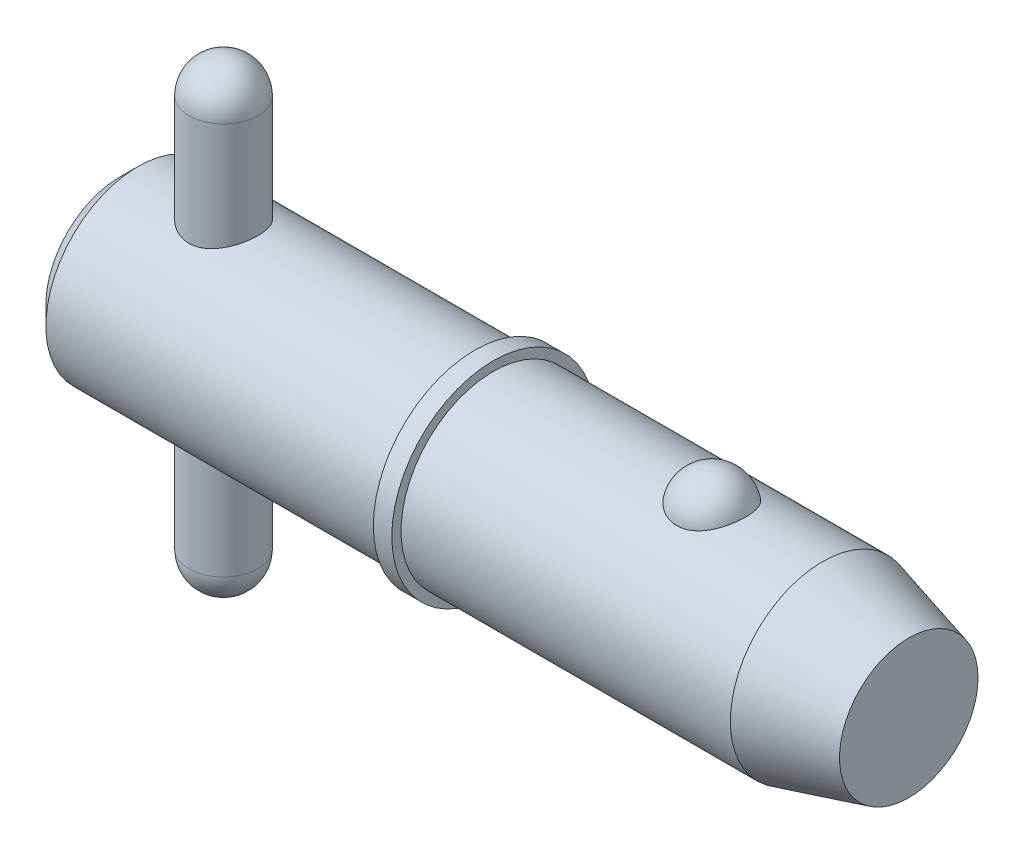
ISO-10303-21;
HEADER;
FILE_DESCRIPTION(('STEP AP214'),'2;1');
FILE_NAME('part.step','',(''),(''),'','','');
FILE_SCHEMA(('AUTOMOTIVE_DESIGN { 1 0 10303 214 1 1 1 1 }'));
ENDSEC;
DATA;
#1=APPLICATION_CONTEXT('core data for automotive mechanical design processes');
#2=APPLICATION_PROTOCOL_DEFINITION('international standard','automotive_design',2000,#1);
#3=PRODUCT_CONTEXT('',#1,'mechanical');
#4=PRODUCT('Part','Part','',(#3));
#5=PRODUCT_RELATED_PRODUCT_CATEGORY('part','',(#4));
#6=PRODUCT_DEFINITION_FORMATION('','',#4);
#7=PRODUCT_DEFINITION_CONTEXT('part definition',#1,'design');
#8=PRODUCT_DEFINITION('design','',#6,#7);
#9=PRODUCT_DEFINITION_SHAPE('','',#8);
#10=(LENGTH_UNIT() NAMED_UNIT(*) SI_UNIT(.MILLI.,.METRE.));
#11=(NAMED_UNIT(*) PLANE_ANGLE_UNIT() SI_UNIT($,.RADIAN.));
#12=(NAMED_UNIT(*) SI_UNIT($,.STERADIAN.) SOLID_ANGLE_UNIT());
#13=UNCERTAINTY_MEASURE_WITH_UNIT(LENGTH_MEASURE(1.E-05),#10,'distance_accuracy_value','');
#14=(GEOMETRIC_REPRESENTATION_CONTEXT(3) GLOBAL_UNCERTAINTY_ASSIGNED_CONTEXT((#13)) GLOBAL_UNIT_ASSIGNED_CONTEXT((#10,
#11,#12)) REPRESENTATION_CONTEXT('',''));
#15=CARTESIAN_POINT('',(0.,0.,0.));
#16=DIRECTION('',(0.,0.,1.));
#17=DIRECTION('',(1.,0.,0.));
#18=AXIS2_PLACEMENT_3D('',#15,#16,#17);
#19=CARTESIAN_POINT('',(7.14,15.875,0.));
#20=DIRECTION('',(0.,-1.,0.));
#21=DIRECTION('',(0.,0.,-1.));
#22=AXIS2_PLACEMENT_3D('',#19,#20,#21);
#23=CYLINDRICAL_SURFACE('',#22,2.38);
#24=CARTESIAN_POINT('',(7.14,-13.495,0.));
#25=DIRECTION('',(0.,-1.,0.));
#26=DIRECTION('',(0.,0.,-1.));
#27=AXIS2_PLACEMENT_3D('',#24,#25,#26);
#28=CIRCLE('',#27,2.38);
#29=CARTESIAN_POINT('',(7.14,-13.495,-2.38));
#30=VERTEX_POINT('',#29);
#31=EDGE_CURVE('P0_E10',#30,#30,#28,.F.);
#32=ORIENTED_EDGE('',*,*,#31,.T.);
#33=EDGE_LOOP('',(#32));
#34=FACE_BOUND('',#33,.T.);
#35=CARTESIAN_POINT('',(7.14,13.495,0.));
#36=DIRECTION('',(0.,-1.,0.));
#37=DIRECTION('',(0.,0.,-1.));
#38=AXIS2_PLACEMENT_3D('',#35,#36,#37);
#39=CIRCLE('',#38,2.38);
#40=CARTESIAN_POINT('',(7.14,13.495,-2.38));
#41=VERTEX_POINT('',#40);
#42=EDGE_CURVE('P0_E21',#41,#41,#39,.T.);
#43=ORIENTED_EDGE('',*,*,#42,.T.);
#44=EDGE_LOOP('',(#43));
#45=FACE_BOUND('',#44,.T.);
#46=ADVANCED_FACE('P0_F14',(#34,#45),#23,.T.);
#47=CARTESIAN_POINT('',(7.14,-13.495,0.));
#48=DIRECTION('',(0.,0.,1.));
#49=DIRECTION('',(1.,0.,0.));
#50=AXIS2_PLACEMENT_3D('',#47,#48,#49);
#51=SPHERICAL_SURFACE('',#50,2.38);
#52=CARTESIAN_POINT('',(7.14,-13.495,0.));
#53=DIRECTION('',(0.,-1.,0.));
#54=DIRECTION('',(0.,0.,-1.));
#55=AXIS2_PLACEMENT_3D('',#52,#53,#54);
#56=SPHERICAL_SURFACE('',#55,2.38);
#57=ORIENTED_EDGE('',*,*,#31,.F.);
#58=EDGE_LOOP('',(#57));
#59=FACE_BOUND('',#58,.T.);
#60=ADVANCED_FACE('P0_F29',(#59),#56,.T.);
#61=CARTESIAN_POINT('',(7.14,13.495,0.));
#62=DIRECTION('',(0.,0.,1.));
#63=DIRECTION('',(1.,0.,0.));
#64=AXIS2_PLACEMENT_3D('',#61,#62,#63);
#65=SPHERICAL_SURFACE('',#64,2.38);
#66=CARTESIAN_POINT('',(7.14,13.495,0.));
#67=DIRECTION('',(0.,-1.,0.));
#68=DIRECTION('',(0.,0.,-1.));
#69=AXIS2_PLACEMENT_3D('',#66,#67,#68);
#70=SPHERICAL_SURFACE('',#69,2.38);
#71=ORIENTED_EDGE('',*,*,#42,.F.);
#72=EDGE_LOOP('',(#71));
#73=FACE_BOUND('',#72,.T.);
#74=ADVANCED_FACE('P0_F16',(#73),#70,.T.);
#75=CLOSED_SHELL('',(#46,#60,#74));
#76=MANIFOLD_SOLID_BREP('P0_B1',#75);
#77=CARTESIAN_POINT('',(0.,0.,0.));
#78=DIRECTION('',(1.,0.,0.));
#79=DIRECTION('',(0.,0.,-1.));
#80=AXIS2_PLACEMENT_3D('',#77,#78,#79);
#81=CYLINDRICAL_SURFACE('',#80,6.35);
#82=CARTESIAN_POINT('',(48.3553693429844,0.,0.));
#83=DIRECTION('',(1.,0.,0.));
#84=DIRECTION('',(0.,0.,-1.));
#85=AXIS2_PLACEMENT_3D('',#82,#83,#84);
#86=CIRCLE('',#85,6.35);
#87=CARTESIAN_POINT('',(48.3553693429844,0.,-6.35));
#88=VERTEX_POINT('',#87);
#89=EDGE_CURVE('P1_E81',#88,#88,#86,.T.);
#90=ORIENTED_EDGE('',*,*,#89,.F.);
#91=EDGE_LOOP('',(#90));
#92=FACE_BOUND('',#91,.T.);
#93=CARTESIAN_POINT('',(25.7,0.,0.));
#94=DIRECTION('',(1.,0.,0.));
#95=DIRECTION('',(0.,0.,-1.));
#96=AXIS2_PLACEMENT_3D('',#93,#94,#95);
#97=CIRCLE('',#96,6.35);
#98=CARTESIAN_POINT('',(25.7,0.,-6.35));
#99=VERTEX_POINT('',#98);
#100=EDGE_CURVE('P1_E85',#99,#99,#97,.T.);
#101=ORIENTED_EDGE('',*,*,#100,.T.);
#102=EDGE_LOOP('',(#101));
#103=FACE_BOUND('',#102,.T.);
#104=CARTESIAN_POINT('',(40.7300214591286,5.87502187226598,2.40969251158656));
#105=CARTESIAN_POINT('',(40.6050305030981,5.87501645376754,2.40969773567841));
#106=CARTESIAN_POINT('',(40.4800806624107,5.87916061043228,2.39967292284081));
#107=CARTESIAN_POINT('',(40.2339091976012,5.89523112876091,2.35991730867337));
#108=CARTESIAN_POINT('',(40.1126863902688,5.90715499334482,2.33019283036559));
#109=CARTESIAN_POINT('',(39.8775170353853,5.9373956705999,2.25201402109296));
#110=CARTESIAN_POINT('',(39.7635602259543,5.95570321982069,2.20358681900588));
#111=CARTESIAN_POINT('',(39.54557352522,5.99672067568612,2.08937987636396));
#112=CARTESIAN_POINT('',(39.4415457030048,6.01943149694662,2.02359652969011));
#113=CARTESIAN_POINT('',(39.2429437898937,6.06760647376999,1.87428969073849));
#114=CARTESIAN_POINT('',(39.1487268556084,6.09313095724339,1.79031110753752));
#115=CARTESIAN_POINT('',(38.9752557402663,6.14375873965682,1.60800178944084));
#116=CARTESIAN_POINT('',(38.8960043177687,6.16886196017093,1.50966841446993));
#117=CARTESIAN_POINT('',(38.7508457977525,6.2172460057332,1.29645884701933));
#118=CARTESIAN_POINT('',(38.6856885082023,6.24039621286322,1.18104158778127));
#119=CARTESIAN_POINT('',(38.5747035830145,6.28117277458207,0.940351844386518));
#120=CARTESIAN_POINT('',(38.5288776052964,6.29879865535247,0.815078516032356));
#121=CARTESIAN_POINT('',(38.4570234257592,6.32692073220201,0.556494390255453));
#122=CARTESIAN_POINT('',(38.431249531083,6.33732517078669,0.423102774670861));
#123=CARTESIAN_POINT('',(38.4009885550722,6.34957673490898,0.153542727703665));
#124=CARTESIAN_POINT('',(38.3965009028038,6.35142408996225,0.0173743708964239));
#125=CARTESIAN_POINT('',(38.4088655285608,6.34638925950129,-0.253036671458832));
#126=CARTESIAN_POINT('',(38.4255949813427,6.33955731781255,-0.387285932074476));
#127=CARTESIAN_POINT('',(38.4798438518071,6.31794129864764,-0.650851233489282));
#128=CARTESIAN_POINT('',(38.5173636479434,6.30315707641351,-0.780167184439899));
#129=CARTESIAN_POINT('',(38.612500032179,6.26711642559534,-1.03041949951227));
#130=CARTESIAN_POINT('',(38.670143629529,6.24585130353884,-1.1513443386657));
#131=CARTESIAN_POINT('',(38.8043522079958,6.19905619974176,-1.38129800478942));
#132=CARTESIAN_POINT('',(38.8809187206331,6.17352587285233,-1.49032586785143));
#133=CARTESIAN_POINT('',(39.051753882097,6.12080227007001,-1.69393164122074));
#134=CARTESIAN_POINT('',(39.1461008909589,6.09360200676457,-1.78844209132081));
#135=CARTESIAN_POINT('',(39.3501196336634,6.0407043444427,-1.95970536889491));
#136=CARTESIAN_POINT('',(39.4597900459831,6.01500681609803,-2.03645972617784));
#137=CARTESIAN_POINT('',(39.6891876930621,5.96867714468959,-2.16845644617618));
#138=CARTESIAN_POINT('',(39.8086522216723,5.94794910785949,-2.22412062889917));
#139=CARTESIAN_POINT('',(40.0562188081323,5.91340580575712,-2.31440992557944));
#140=CARTESIAN_POINT('',(40.1843175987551,5.89958794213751,-2.34904294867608));
#141=CARTESIAN_POINT('',(40.438582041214,5.88111049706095,-2.39491590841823));
#142=CARTESIAN_POINT('',(40.5645207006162,5.876025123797,-2.40724512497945));
#143=CARTESIAN_POINT('',(40.8167867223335,5.87428980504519,-2.41147867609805));
#144=CARTESIAN_POINT('',(40.943114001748,5.87763817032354,-2.40338710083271));
#145=CARTESIAN_POINT('',(41.1884170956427,5.89212921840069,-2.36762715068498));
#146=CARTESIAN_POINT('',(41.3074992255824,5.90302431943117,-2.34058030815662));
#147=CARTESIAN_POINT('',(41.5392447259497,5.93113752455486,-2.26839066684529));
#148=CARTESIAN_POINT('',(41.6519075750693,5.94835614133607,-2.22324640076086));
#149=CARTESIAN_POINT('',(41.8704009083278,5.98773016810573,-2.11493806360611));
#150=CARTESIAN_POINT('',(41.976028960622,6.00998499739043,-2.05140269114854));
#151=CARTESIAN_POINT('',(42.1753006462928,6.0569014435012,-1.90842705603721));
#152=CARTESIAN_POINT('',(42.2689415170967,6.08156361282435,-1.82898313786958));
#153=CARTESIAN_POINT('',(42.4466754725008,6.13211715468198,-1.65182429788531));
#154=CARTESIAN_POINT('',(42.530055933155,6.15800825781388,-1.55339381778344));
#155=CARTESIAN_POINT('',(42.6797900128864,6.20712834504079,-1.34374214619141));
#156=CARTESIAN_POINT('',(42.7461405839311,6.23035685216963,-1.23251867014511));
#157=CARTESIAN_POINT('',(42.8623455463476,6.27251177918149,-0.996447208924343));
#158=CARTESIAN_POINT('',(42.9116072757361,6.29127762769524,-0.871278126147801));
#159=CARTESIAN_POINT('',(42.9896142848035,6.3215862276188,-0.613870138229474));
#160=CARTESIAN_POINT('',(43.0183593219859,6.33312889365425,-0.481631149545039));
#161=CARTESIAN_POINT('',(43.0547705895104,6.34782349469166,-0.213672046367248));
#162=CARTESIAN_POINT('',(43.0624134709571,6.35096613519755,-0.0779482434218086));
#163=CARTESIAN_POINT('',(43.0563951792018,6.34851322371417,0.192943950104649));
#164=CARTESIAN_POINT('',(43.0427343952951,6.3429178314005,0.328112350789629));
#165=CARTESIAN_POINT('',(42.9945036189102,6.32360512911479,0.593406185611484));
#166=CARTESIAN_POINT('',(42.9600313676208,6.30992579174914,0.723552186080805));
#167=CARTESIAN_POINT('',(42.8709539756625,6.27586325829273,0.975834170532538));
#168=CARTESIAN_POINT('',(42.8163476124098,6.25547965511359,1.09796966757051));
#169=CARTESIAN_POINT('',(42.6877587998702,6.20998183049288,1.33148921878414));
#170=CARTESIAN_POINT('',(42.6136742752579,6.18484288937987,1.44281227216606));
#171=CARTESIAN_POINT('',(42.4478204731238,6.13258735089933,1.65087683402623));
#172=CARTESIAN_POINT('',(42.3560515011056,6.10547078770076,1.74761859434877));
#173=CARTESIAN_POINT('',(42.1571839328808,6.05235879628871,1.92350926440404));
#174=CARTESIAN_POINT('',(42.050133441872,6.02636017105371,2.00271146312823));
#175=CARTESIAN_POINT('',(41.8231384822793,5.97843747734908,2.14154159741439));
#176=CARTESIAN_POINT('',(41.703191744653,5.95651412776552,2.2011660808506));
#177=CARTESIAN_POINT('',(41.4445236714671,5.91812106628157,2.30250570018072));
#178=CARTESIAN_POINT('',(41.3050698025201,5.90217533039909,2.34256795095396));
#179=CARTESIAN_POINT('',(41.0203974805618,5.88063128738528,2.39615214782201));
#180=CARTESIAN_POINT('',(40.8751817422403,5.87502816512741,2.40968644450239));
#181=CARTESIAN_POINT('',(40.7300214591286,5.87502187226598,2.40969251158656));
#182=B_SPLINE_CURVE_WITH_KNOTS('',3,(#104,#105,#106,#107,#108,#109,#110,#111,#112,#113,#114,
#115,#116,#117,#118,#119,#120,#121,#122,#123,#124,#125,#126,#127,#128,#129,#130,#131,#132,#133,
#134,#135,#136,#137,#138,#139,#140,#141,#142,#143,#144,#145,#146,#147,#148,#149,#150,#151,#152,
#153,#154,#155,#156,#157,#158,#159,#160,#161,#162,#163,#164,#165,#166,#167,#168,#169,#170,#171,
#172,#173,#174,#175,#176,#177,#178,#179,#180,#181),.UNSPECIFIED.,.T.,.F.,(4,2,2,2,2,2,2,2,2,2,2,
2,2,2,2,2,2,2,2,2,2,2,2,2,2,2,2,2,2,2,2,2,2,2,2,2,2,2,4),(0.,0.374440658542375,
0.748761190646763,1.12254078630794,1.49639810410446,1.88098871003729,2.26565013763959,
2.66741104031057,3.0692063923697,3.47601794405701,3.88281858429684,4.28727498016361,
4.69173873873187,5.09674745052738,5.50178895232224,5.90865911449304,6.31549420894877,
6.71369855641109,7.11175305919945,7.48978077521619,7.86773278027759,8.23383886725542,
8.59997464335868,8.97409044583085,9.34829231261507,9.7412266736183,10.1342313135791,
10.539752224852,10.945277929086,11.3512521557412,11.7572189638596,12.1612938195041,
12.5653932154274,12.9716540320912,13.37790783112,13.782909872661,14.1879832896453,
14.6230486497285,15.0579114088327),.UNSPECIFIED.);
#183=CARTESIAN_POINT('',(40.7300214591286,5.87502187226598,2.40969251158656));
#184=VERTEX_POINT('',#183);
#185=EDGE_CURVE('P1_E35',#184,#184,#182,.T.);
#186=ORIENTED_EDGE('',*,*,#185,.T.);
#187=EDGE_LOOP('',(#186));
#188=FACE_BOUND('',#187,.T.);
#189=ADVANCED_FACE('P1_F13',(#92,#103,#188),#81,.T.);
#190=CARTESIAN_POINT('',(0.,0.,0.));
#191=DIRECTION('',(-1.,0.,0.));
#192=DIRECTION('',(0.,0.,1.));
#193=AXIS2_PLACEMENT_3D('',#190,#191,#192);
#194=PLANE('',#193);
#195=CARTESIAN_POINT('',(0.,0.,0.));
#196=DIRECTION('',(1.,0.,0.));
#197=DIRECTION('',(0.,0.,-1.));
#198=AXIS2_PLACEMENT_3D('',#195,#196,#197);
#199=CIRCLE('',#198,5.08);
#200=CARTESIAN_POINT('',(0.,0.,-5.08));
#201=VERTEX_POINT('',#200);
#202=EDGE_CURVE('P1_E9',#201,#201,#199,.T.);
#203=ORIENTED_EDGE('',*,*,#202,.F.);
#204=EDGE_LOOP('',(#203));
#205=FACE_BOUND('',#204,.T.);
#206=ADVANCED_FACE('P1_F15',(#205),#194,.T.);
#207=CARTESIAN_POINT('',(1.27,0.,0.));
#208=DIRECTION('',(1.,0.,0.));
#209=DIRECTION('',(0.,0.,-1.));
#210=AXIS2_PLACEMENT_3D('',#207,#208,#209);
#211=CONICAL_SURFACE('',#210,6.35,0.78539816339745);
#212=ORIENTED_EDGE('',*,*,#202,.T.);
#213=EDGE_LOOP('',(#212));
#214=FACE_BOUND('',#213,.T.);
#215=CARTESIAN_POINT('',(1.27,0.,0.));
#216=DIRECTION('',(1.,0.,0.));
#217=DIRECTION('',(0.,0.,-1.));
#218=AXIS2_PLACEMENT_3D('',#215,#216,#217);
#219=CIRCLE('',#218,6.35);
#220=CARTESIAN_POINT('',(1.27,0.,-6.35));
#221=VERTEX_POINT('',#220);
#222=EDGE_CURVE('P1_E26',#221,#221,#219,.T.);
#223=ORIENTED_EDGE('',*,*,#222,.F.);
#224=EDGE_LOOP('',(#223));
#225=FACE_BOUND('',#224,.T.);
#226=ADVANCED_FACE('P1_F77',(#214,#225),#211,.T.);
#227=CARTESIAN_POINT('',(0.,0.,0.));
#228=DIRECTION('',(1.,0.,0.));
#229=DIRECTION('',(0.,0.,-1.));
#230=AXIS2_PLACEMENT_3D('',#227,#228,#229);
#231=CYLINDRICAL_SURFACE('',#230,6.35);
#232=CARTESIAN_POINT('',(7.14,-5.88711304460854,2.38));
#233=CARTESIAN_POINT('',(7.01146258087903,-5.88710856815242,2.38000480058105));
#234=CARTESIAN_POINT('',(6.88295682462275,-5.89136840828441,2.36955244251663));
#235=CARTESIAN_POINT('',(6.62981934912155,-5.90782785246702,2.32820953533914));
#236=CARTESIAN_POINT('',(6.50518751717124,-5.92002722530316,2.29731958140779));
#237=CARTESIAN_POINT('',(6.26352403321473,-5.95079384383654,2.21639366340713));
#238=CARTESIAN_POINT('',(6.14647496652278,-5.96934583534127,2.16640353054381));
#239=CARTESIAN_POINT('',(5.92237941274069,-6.01070278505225,2.04885862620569));
#240=CARTESIAN_POINT('',(5.81533593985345,-6.03350901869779,1.98129858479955));
#241=CARTESIAN_POINT('',(5.60897525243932,-6.08207341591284,1.82693902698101));
#242=CARTESIAN_POINT('',(5.51022503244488,-6.10791836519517,1.73940861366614));
#243=CARTESIAN_POINT('',(5.32840561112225,-6.15892405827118,1.54914379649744));
#244=CARTESIAN_POINT('',(5.24533975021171,-6.1840846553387,1.44640616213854));
#245=CARTESIAN_POINT('',(5.09451639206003,-6.23191821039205,1.22434014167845));
#246=CARTESIAN_POINT('',(5.02737511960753,-6.25447755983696,1.10456656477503));
#247=CARTESIAN_POINT('',(4.91443001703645,-6.2935236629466,0.854429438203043));
#248=CARTESIAN_POINT('',(4.86861879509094,-6.31001251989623,0.724069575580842));
#249=CARTESIAN_POINT('',(4.80162253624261,-6.33444370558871,0.46242122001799));
#250=CARTESIAN_POINT('',(4.77946137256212,-6.34272370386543,0.331414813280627));
#251=CARTESIAN_POINT('',(4.75726677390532,-6.35101600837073,0.0672982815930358));
#252=CARTESIAN_POINT('',(4.75722615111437,-6.35103100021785,-0.0658111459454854));
#253=CARTESIAN_POINT('',(4.77870510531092,-6.3430064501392,-0.323358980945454));
#254=CARTESIAN_POINT('',(4.79915922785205,-6.33536494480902,-0.447900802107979));
#255=CARTESIAN_POINT('',(4.85925493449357,-6.31340794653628,-0.69163609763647));
#256=CARTESIAN_POINT('',(4.89889787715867,-6.29909198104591,-0.810829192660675));
#257=CARTESIAN_POINT('',(4.9967414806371,-6.26494471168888,-1.04254212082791));
#258=CARTESIAN_POINT('',(5.05520370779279,-6.24503620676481,-1.1549396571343));
#259=CARTESIAN_POINT('',(5.1887948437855,-6.20171869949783,-1.3686079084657));
#260=CARTESIAN_POINT('',(5.26392912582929,-6.17830856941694,-1.46987502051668));
#261=CARTESIAN_POINT('',(5.43386591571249,-6.12878580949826,-1.66468415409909));
#262=CARTESIAN_POINT('',(5.52956139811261,-6.10259519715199,-1.75742857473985));
#263=CARTESIAN_POINT('',(5.73530435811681,-6.05155777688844,-1.92585331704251));
#264=CARTESIAN_POINT('',(5.84535542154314,-6.02671130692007,-2.00152936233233));
#265=CARTESIAN_POINT('',(6.07982989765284,-5.98068420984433,-2.13519109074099));
#266=CARTESIAN_POINT('',(6.20451768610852,-5.95959698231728,-2.19274775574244));
#267=CARTESIAN_POINT('',(6.4628145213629,-5.92455622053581,-2.28574558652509));
#268=CARTESIAN_POINT('',(6.59641856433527,-5.91059872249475,-2.32119904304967));
#269=CARTESIAN_POINT('',(6.86087441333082,-5.8923327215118,-2.36717069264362));
#270=CARTESIAN_POINT('',(6.99147192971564,-5.8875347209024,-2.37895573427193));
#271=CARTESIAN_POINT('',(7.25283805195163,-5.88674545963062,-2.38091046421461));
#272=CARTESIAN_POINT('',(7.38360660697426,-5.89075200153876,-2.37108554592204));
#273=CARTESIAN_POINT('',(7.63510696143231,-5.90662331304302,-2.33124781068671));
#274=CARTESIAN_POINT('',(7.75602069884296,-5.91810660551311,-2.30221396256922));
#275=CARTESIAN_POINT('',(7.99120505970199,-5.94718527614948,-2.22601401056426));
#276=CARTESIAN_POINT('',(8.10547431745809,-5.96478190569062,-2.17884419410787));
#277=CARTESIAN_POINT('',(8.32888632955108,-6.00491533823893,-2.06572311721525));
#278=CARTESIAN_POINT('',(8.43767672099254,-6.02761250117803,-1.99913452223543));
#279=CARTESIAN_POINT('',(8.6429894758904,-6.07511988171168,-1.84974438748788));
#280=CARTESIAN_POINT('',(8.73950733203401,-6.09993087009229,-1.76693691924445));
#281=CARTESIAN_POINT('',(8.9238741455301,-6.1507686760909,-1.58125563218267));
#282=CARTESIAN_POINT('',(9.01078732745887,-6.17677301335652,-1.47744327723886));
#283=CARTESIAN_POINT('',(9.16607127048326,-6.22556172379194,-1.25606967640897));
#284=CARTESIAN_POINT('',(9.23444197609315,-6.24834608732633,-1.13850838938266));
#285=CARTESIAN_POINT('',(9.3502493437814,-6.28811144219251,-0.893050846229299));
#286=CARTESIAN_POINT('',(9.39775808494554,-6.30511236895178,-0.765192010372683));
#287=CARTESIAN_POINT('',(9.47032640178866,-6.33145833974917,-0.502514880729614));
#288=CARTESIAN_POINT('',(9.49539651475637,-6.34080697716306,-0.367699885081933));
#289=CARTESIAN_POINT('',(9.52124059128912,-6.35045496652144,-0.103396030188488));
#290=CARTESIAN_POINT('',(9.52334421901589,-6.35124952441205,0.025945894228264));
#291=CARTESIAN_POINT('',(9.50661518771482,-6.34499064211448,0.283061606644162));
#292=CARTESIAN_POINT('',(9.48778504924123,-6.33793814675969,0.410835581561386));
#293=CARTESIAN_POINT('',(9.43065630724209,-6.31700307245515,0.658028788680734));
#294=CARTESIAN_POINT('',(9.39284291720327,-6.30329098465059,0.7775756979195));
#295=CARTESIAN_POINT('',(9.29930406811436,-6.27046903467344,1.00863789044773));
#296=CARTESIAN_POINT('',(9.2435752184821,-6.25135815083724,1.12015164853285));
#297=CARTESIAN_POINT('',(9.11312349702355,-6.20865254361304,1.33711407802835));
#298=CARTESIAN_POINT('',(9.03770094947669,-6.18490316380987,1.44211105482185));
#299=CARTESIAN_POINT('',(8.87110640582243,-6.13583718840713,1.63836897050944));
#300=CARTESIAN_POINT('',(8.77992879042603,-6.11052003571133,1.72962498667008));
#301=CARTESIAN_POINT('',(8.57869799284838,-6.05953829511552,1.90076098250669));
#302=CARTESIAN_POINT('',(8.46790320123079,-6.03392573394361,1.97978778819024));
#303=CARTESIAN_POINT('',(8.23379693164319,-5.98676607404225,2.11813466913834));
#304=CARTESIAN_POINT('',(8.11048418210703,-5.9652193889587,2.17745273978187));
#305=CARTESIAN_POINT('',(7.84900037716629,-5.92818393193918,2.27641807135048));
#306=CARTESIAN_POINT('',(7.71041678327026,-5.91299857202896,2.31510015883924));
#307=CARTESIAN_POINT('',(7.42787316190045,-5.89246887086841,2.36688002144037));
#308=CARTESIAN_POINT('',(7.28391673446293,-5.88711805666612,2.37999462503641));
#309=CARTESIAN_POINT('',(7.14,-5.88711304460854,2.38));
#310=B_SPLINE_CURVE_WITH_KNOTS('',3,(#232,#233,#234,#235,#236,#237,#238,#239,#240,#241,#242,
#243,#244,#245,#246,#247,#248,#249,#250,#251,#252,#253,#254,#255,#256,#257,#258,#259,#260,#261,
#262,#263,#264,#265,#266,#267,#268,#269,#270,#271,#272,#273,#274,#275,#276,#277,#278,#279,#280,
#281,#282,#283,#284,#285,#286,#287,#288,#289,#290,#291,#292,#293,#294,#295,#296,#297,#298,#299,
#300,#301,#302,#303,#304,#305,#306,#307,#308,#309),.UNSPECIFIED.,.T.,.F.,(4,2,2,2,2,2,2,2,2,2,2,
2,2,2,2,2,2,2,2,2,2,2,2,2,2,2,2,2,2,2,2,2,2,2,2,2,2,2,4),(0.,0.385076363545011,
0.770141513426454,1.15428843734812,1.53855071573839,1.94016118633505,2.3418570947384,
2.75720522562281,3.1724093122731,3.569721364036,3.96690431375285,4.34445758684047,
4.72203759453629,5.10511017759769,5.48830640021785,5.89390240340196,6.29959991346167,
6.71428455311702,7.12873839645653,7.52034494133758,7.91185376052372,8.28480528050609,
8.65783318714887,9.0448340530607,9.43197664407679,9.84363087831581,10.2552863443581,
10.6655081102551,11.0755371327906,11.4616919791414,11.847800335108,12.224507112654,
12.6012852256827,12.9938941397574,13.386643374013,13.8000944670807,14.2135876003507,
14.6450218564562,15.0761720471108),.UNSPECIFIED.);
#311=CARTESIAN_POINT('',(7.14,-5.88711304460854,2.38));
#312=VERTEX_POINT('',#311);
#313=EDGE_CURVE('P1_E17',#312,#312,#310,.T.);
#314=ORIENTED_EDGE('',*,*,#313,.F.);
#315=EDGE_LOOP('',(#314));
#316=FACE_BOUND('',#315,.T.);
#317=CARTESIAN_POINT('',(7.14,5.88711304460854,2.38));
#318=CARTESIAN_POINT('',(7.26853741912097,5.88710856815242,2.38000480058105));
#319=CARTESIAN_POINT('',(7.39704317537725,5.89136840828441,2.36955244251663));
#320=CARTESIAN_POINT('',(7.65018065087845,5.90782785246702,2.32820953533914));
#321=CARTESIAN_POINT('',(7.77481248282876,5.92002722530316,2.29731958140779));
#322=CARTESIAN_POINT('',(8.01647596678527,5.95079384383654,2.21639366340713));
#323=CARTESIAN_POINT('',(8.13352503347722,5.96934583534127,2.16640353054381));
#324=CARTESIAN_POINT('',(8.35762058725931,6.01070278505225,2.04885862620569));
#325=CARTESIAN_POINT('',(8.46466406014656,6.03350901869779,1.98129858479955));
#326=CARTESIAN_POINT('',(8.67102474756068,6.08207341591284,1.82693902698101));
#327=CARTESIAN_POINT('',(8.76977496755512,6.10791836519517,1.73940861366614));
#328=CARTESIAN_POINT('',(8.95159438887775,6.15892405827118,1.54914379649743));
#329=CARTESIAN_POINT('',(9.03466024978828,6.1840846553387,1.44640616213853));
#330=CARTESIAN_POINT('',(9.18548360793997,6.23191821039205,1.22434014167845));
#331=CARTESIAN_POINT('',(9.25262488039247,6.25447755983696,1.10456656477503));
#332=CARTESIAN_POINT('',(9.36556998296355,6.2935236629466,0.854429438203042));
#333=CARTESIAN_POINT('',(9.41138120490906,6.31001251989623,0.72406957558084));
#334=CARTESIAN_POINT('',(9.47837746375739,6.33444370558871,0.462421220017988));
#335=CARTESIAN_POINT('',(9.50053862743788,6.34272370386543,0.331414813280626));
#336=CARTESIAN_POINT('',(9.52273322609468,6.35101600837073,0.0672982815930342));
#337=CARTESIAN_POINT('',(9.52277384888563,6.35103100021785,-0.0658111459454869));
#338=CARTESIAN_POINT('',(9.50129489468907,6.3430064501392,-0.323358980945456));
#339=CARTESIAN_POINT('',(9.48084077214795,6.33536494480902,-0.447900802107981));
#340=CARTESIAN_POINT('',(9.42074506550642,6.31340794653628,-0.691636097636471));
#341=CARTESIAN_POINT('',(9.38110212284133,6.29909198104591,-0.810829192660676));
#342=CARTESIAN_POINT('',(9.2832585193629,6.26494471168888,-1.04254212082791));
#343=CARTESIAN_POINT('',(9.22479629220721,6.24503620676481,-1.1549396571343));
#344=CARTESIAN_POINT('',(9.0912051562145,6.20171869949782,-1.3686079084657));
#345=CARTESIAN_POINT('',(9.0160708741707,6.17830856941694,-1.46987502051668));
#346=CARTESIAN_POINT('',(8.84613408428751,6.12878580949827,-1.66468415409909));
#347=CARTESIAN_POINT('',(8.75043860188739,6.10259519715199,-1.75742857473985));
#348=CARTESIAN_POINT('',(8.54469564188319,6.05155777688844,-1.92585331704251));
#349=CARTESIAN_POINT('',(8.43464457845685,6.02671130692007,-2.00152936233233));
#350=CARTESIAN_POINT('',(8.20017010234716,5.98068420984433,-2.13519109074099));
#351=CARTESIAN_POINT('',(8.07548231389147,5.95959698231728,-2.19274775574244));
#352=CARTESIAN_POINT('',(7.8171854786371,5.9245562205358,-2.28574558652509));
#353=CARTESIAN_POINT('',(7.68358143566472,5.91059872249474,-2.32119904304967));
#354=CARTESIAN_POINT('',(7.41912558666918,5.8923327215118,-2.36717069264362));
#355=CARTESIAN_POINT('',(7.28852807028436,5.8875347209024,-2.37895573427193));
#356=CARTESIAN_POINT('',(7.02716194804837,5.88674545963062,-2.38091046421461));
#357=CARTESIAN_POINT('',(6.89639339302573,5.89075200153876,-2.37108554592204));
#358=CARTESIAN_POINT('',(6.64489303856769,5.90662331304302,-2.33124781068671));
#359=CARTESIAN_POINT('',(6.52397930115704,5.91810660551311,-2.30221396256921));
#360=CARTESIAN_POINT('',(6.288794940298,5.94718527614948,-2.22601401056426));
#361=CARTESIAN_POINT('',(6.17452568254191,5.96478190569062,-2.17884419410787));
#362=CARTESIAN_POINT('',(5.95111367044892,6.00491533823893,-2.06572311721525));
#363=CARTESIAN_POINT('',(5.84232327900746,6.02761250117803,-1.99913452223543));
#364=CARTESIAN_POINT('',(5.6370105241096,6.07511988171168,-1.84974438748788));
#365=CARTESIAN_POINT('',(5.54049266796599,6.09993087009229,-1.76693691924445));
#366=CARTESIAN_POINT('',(5.3561258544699,6.1507686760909,-1.58125563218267));
#367=CARTESIAN_POINT('',(5.26921267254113,6.17677301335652,-1.47744327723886));
#368=CARTESIAN_POINT('',(5.11392872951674,6.22556172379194,-1.25606967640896));
#369=CARTESIAN_POINT('',(5.04555802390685,6.24834608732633,-1.13850838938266));
#370=CARTESIAN_POINT('',(4.9297506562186,6.28811144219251,-0.893050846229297));
#371=CARTESIAN_POINT('',(4.88224191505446,6.30511236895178,-0.76519201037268));
#372=CARTESIAN_POINT('',(4.80967359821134,6.33145833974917,-0.502514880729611));
#373=CARTESIAN_POINT('',(4.78460348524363,6.34080697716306,-0.36769988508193));
#374=CARTESIAN_POINT('',(4.75875940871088,6.35045496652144,-0.103396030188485));
#375=CARTESIAN_POINT('',(4.75665578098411,6.35124952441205,0.025945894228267));
#376=CARTESIAN_POINT('',(4.77338481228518,6.34499064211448,0.283061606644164));
#377=CARTESIAN_POINT('',(4.79221495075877,6.33793814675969,0.410835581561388));
#378=CARTESIAN_POINT('',(4.84934369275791,6.31700307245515,0.658028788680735));
#379=CARTESIAN_POINT('',(4.88715708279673,6.30329098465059,0.777575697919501));
#380=CARTESIAN_POINT('',(4.98069593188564,6.27046903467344,1.00863789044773));
#381=CARTESIAN_POINT('',(5.0364247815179,6.25135815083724,1.12015164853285));
#382=CARTESIAN_POINT('',(5.16687650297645,6.20865254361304,1.33711407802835));
#383=CARTESIAN_POINT('',(5.24229905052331,6.18490316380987,1.44211105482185));
#384=CARTESIAN_POINT('',(5.40889359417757,6.13583718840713,1.63836897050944));
#385=CARTESIAN_POINT('',(5.50007120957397,6.11052003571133,1.72962498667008));
#386=CARTESIAN_POINT('',(5.70130200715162,6.05953829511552,1.90076098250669));
#387=CARTESIAN_POINT('',(5.81209679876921,6.03392573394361,1.97978778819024));
#388=CARTESIAN_POINT('',(6.04620306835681,5.98676607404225,2.11813466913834));
#389=CARTESIAN_POINT('',(6.16951581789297,5.9652193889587,2.17745273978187));
#390=CARTESIAN_POINT('',(6.43099962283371,5.92818393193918,2.27641807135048));
#391=CARTESIAN_POINT('',(6.56958321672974,5.91299857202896,2.31510015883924));
#392=CARTESIAN_POINT('',(6.85212683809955,5.89246887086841,2.36688002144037));
#393=CARTESIAN_POINT('',(6.99608326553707,5.88711805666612,2.37999462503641));
#394=CARTESIAN_POINT('',(7.14,5.88711304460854,2.38));
#395=B_SPLINE_CURVE_WITH_KNOTS('',3,(#317,#318,#319,#320,#321,#322,#323,#324,#325,#326,#327,
#328,#329,#330,#331,#332,#333,#334,#335,#336,#337,#338,#339,#340,#341,#342,#343,#344,#345,#346,
#347,#348,#349,#350,#351,#352,#353,#354,#355,#356,#357,#358,#359,#360,#361,#362,#363,#364,#365,
#366,#367,#368,#369,#370,#371,#372,#373,#374,#375,#376,#377,#378,#379,#380,#381,#382,#383,#384,
#385,#386,#387,#388,#389,#390,#391,#392,#393,#394),.UNSPECIFIED.,.T.,.F.,(4,2,2,2,2,2,2,2,2,2,2,
2,2,2,2,2,2,2,2,2,2,2,2,2,2,2,2,2,2,2,2,2,2,2,2,2,2,2,4),(0.,0.385076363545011,
0.770141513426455,1.15428843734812,1.53855071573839,1.94016118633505,2.3418570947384,
2.75720522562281,3.1724093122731,3.56972136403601,3.96690431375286,4.34445758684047,
4.72203759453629,5.10511017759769,5.48830640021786,5.89390240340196,6.29959991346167,
6.71428455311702,7.12873839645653,7.52034494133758,7.91185376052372,8.2848052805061,
8.65783318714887,9.0448340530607,9.43197664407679,9.84363087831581,10.2552863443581,
10.6655081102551,11.0755371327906,11.4616919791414,11.847800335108,12.2245071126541,
12.6012852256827,12.9938941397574,13.386643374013,13.8000944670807,14.2135876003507,
14.6450218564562,15.0761720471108),.UNSPECIFIED.);
#396=CARTESIAN_POINT('',(7.14,5.88711304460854,2.38));
#397=VERTEX_POINT('',#396);
#398=EDGE_CURVE('P1_E43',#397,#397,#395,.T.);
#399=ORIENTED_EDGE('',*,*,#398,.F.);
#400=EDGE_LOOP('',(#399));
#401=FACE_BOUND('',#400,.T.);
#402=ORIENTED_EDGE('',*,*,#222,.T.);
#403=EDGE_LOOP('',(#402));
#404=FACE_BOUND('',#403,.T.);
#405=CARTESIAN_POINT('',(24.43,0.,0.));
#406=DIRECTION('',(1.,0.,0.));
#407=DIRECTION('',(0.,0.,-1.));
#408=AXIS2_PLACEMENT_3D('',#405,#406,#407);
#409=CIRCLE('',#408,6.35);
#410=CARTESIAN_POINT('',(24.43,0.,-6.35));
#411=VERTEX_POINT('',#410);
#412=EDGE_CURVE('P1_E31',#411,#411,#409,.T.);
#413=ORIENTED_EDGE('',*,*,#412,.F.);
#414=EDGE_LOOP('',(#413));
#415=FACE_BOUND('',#414,.T.);
#416=ADVANCED_FACE('P1_F103',(#316,#401,#404,#415),#231,.T.);
#417=CARTESIAN_POINT('',(24.43,6.35,0.));
#418=DIRECTION('',(-1.,0.,0.));
#419=DIRECTION('',(0.,0.,1.));
#420=AXIS2_PLACEMENT_3D('',#417,#418,#419);
#421=PLANE('',#420);
#422=ORIENTED_EDGE('',*,*,#412,.T.);
#423=EDGE_LOOP('',(#422));
#424=FACE_BOUND('',#423,.T.);
#425=CARTESIAN_POINT('',(24.43,0.,0.));
#426=DIRECTION('',(1.,0.,0.));
#427=DIRECTION('',(0.,0.,-1.));
#428=AXIS2_PLACEMENT_3D('',#425,#426,#427);
#429=CIRCLE('',#428,6.985);
#430=CARTESIAN_POINT('',(24.43,0.,-6.985));
#431=VERTEX_POINT('',#430);
#432=EDGE_CURVE('P1_E91',#431,#431,#429,.T.);
#433=ORIENTED_EDGE('',*,*,#432,.F.);
#434=EDGE_LOOP('',(#433));
#435=FACE_BOUND('',#434,.T.);
#436=ADVANCED_FACE('P1_F100',(#424,#435),#421,.T.);
#437=CARTESIAN_POINT('',(0.,0.,0.));
#438=DIRECTION('',(1.,0.,0.));
#439=DIRECTION('',(0.,0.,-1.));
#440=AXIS2_PLACEMENT_3D('',#437,#438,#439);
#441=CYLINDRICAL_SURFACE('',#440,6.985);
#442=ORIENTED_EDGE('',*,*,#432,.T.);
#443=EDGE_LOOP('',(#442));
#444=FACE_BOUND('',#443,.T.);
#445=CARTESIAN_POINT('',(25.7,0.,0.));
#446=DIRECTION('',(1.,0.,0.));
#447=DIRECTION('',(0.,0.,-1.));
#448=AXIS2_PLACEMENT_3D('',#445,#446,#447);
#449=CIRCLE('',#448,6.985);
#450=CARTESIAN_POINT('',(25.7,0.,-6.985));
#451=VERTEX_POINT('',#450);
#452=EDGE_CURVE('P1_E88',#451,#451,#449,.T.);
#453=ORIENTED_EDGE('',*,*,#452,.F.);
#454=EDGE_LOOP('',(#453));
#455=FACE_BOUND('',#454,.T.);
#456=ADVANCED_FACE('P1_F68',(#444,#455),#441,.T.);
#457=CARTESIAN_POINT('',(25.7,6.985,0.));
#458=DIRECTION('',(1.,0.,0.));
#459=DIRECTION('',(0.,0.,-1.));
#460=AXIS2_PLACEMENT_3D('',#457,#458,#459);
#461=PLANE('',#460);
#462=ORIENTED_EDGE('',*,*,#452,.T.);
#463=EDGE_LOOP('',(#462));
#464=FACE_BOUND('',#463,.T.);
#465=ORIENTED_EDGE('',*,*,#100,.F.);
#466=EDGE_LOOP('',(#465));
#467=FACE_BOUND('',#466,.T.);
#468=ADVANCED_FACE('P1_F62',(#464,#467),#461,.T.);
#469=CARTESIAN_POINT('',(54.28,0.,0.));
#470=DIRECTION('',(-1.,0.,0.));
#471=DIRECTION('',(0.,0.,1.));
#472=AXIS2_PLACEMENT_3D('',#469,#470,#471);
#473=CONICAL_SURFACE('',#472,4.76250000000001,0.26179938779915);
#474=ORIENTED_EDGE('',*,*,#89,.T.);
#475=EDGE_LOOP('',(#474));
#476=FACE_BOUND('',#475,.T.);
#477=CARTESIAN_POINT('',(54.28,0.,0.));
#478=DIRECTION('',(1.,0.,0.));
#479=DIRECTION('',(0.,0.,-1.));
#480=AXIS2_PLACEMENT_3D('',#477,#478,#479);
#481=CIRCLE('',#480,4.76250000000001);
#482=CARTESIAN_POINT('',(54.28,0.,-4.76250000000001));
#483=VERTEX_POINT('',#482);
#484=EDGE_CURVE('P1_E42',#483,#483,#481,.T.);
#485=ORIENTED_EDGE('',*,*,#484,.F.);
#486=EDGE_LOOP('',(#485));
#487=FACE_BOUND('',#486,.T.);
#488=ADVANCED_FACE('P1_F59',(#476,#487),#473,.T.);
#489=CARTESIAN_POINT('',(54.28,4.76250000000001,0.));
#490=DIRECTION('',(1.,0.,0.));
#491=DIRECTION('',(0.,0.,-1.));
#492=AXIS2_PLACEMENT_3D('',#489,#490,#491);
#493=PLANE('',#492);
#494=ORIENTED_EDGE('',*,*,#484,.T.);
#495=EDGE_LOOP('',(#494));
#496=FACE_BOUND('',#495,.T.);
#497=ADVANCED_FACE('P1_F55',(#496),#493,.T.);
#498=CARTESIAN_POINT('',(40.7300214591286,5.715,0.));
#499=DIRECTION('',(-1.,0.,0.));
#500=DIRECTION('',(0.,1.,0.));
#501=AXIS2_PLACEMENT_3D('',#498,#499,#500);
#502=SPHERICAL_SURFACE('',#501,2.41499999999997);
#503=ORIENTED_EDGE('',*,*,#185,.F.);
#504=EDGE_LOOP('',(#503));
#505=FACE_BOUND('',#504,.T.);
#506=ADVANCED_FACE('P1_F50',(#505),#502,.T.);
#507=CARTESIAN_POINT('',(7.14,-6.985,0.));
#508=DIRECTION('',(0.,1.,0.));
#509=DIRECTION('',(0.,0.,1.));
#510=AXIS2_PLACEMENT_3D('',#507,#508,#509);
#511=CYLINDRICAL_SURFACE('',#510,2.38);
#512=ORIENTED_EDGE('',*,*,#313,.T.);
#513=EDGE_LOOP('',(#512));
#514=FACE_BOUND('',#513,.T.);
#515=ORIENTED_EDGE('',*,*,#398,.T.);
#516=EDGE_LOOP('',(#515));
#517=FACE_BOUND('',#516,.T.);
#518=ADVANCED_FACE('P1_F54',(#514,#517),#511,.F.);
#519=CLOSED_SHELL('',(#189,#206,#226,#416,#436,#456,#468,#488,#497,#506,#518));
#520=MANIFOLD_SOLID_BREP('P1_B1',#519);
#521=ADVANCED_BREP_SHAPE_REPRESENTATION('',(#18,#76,#520),#14);
#522=SHAPE_DEFINITION_REPRESENTATION(#9,#521);
ENDSEC;
END-ISO-10303-21;
